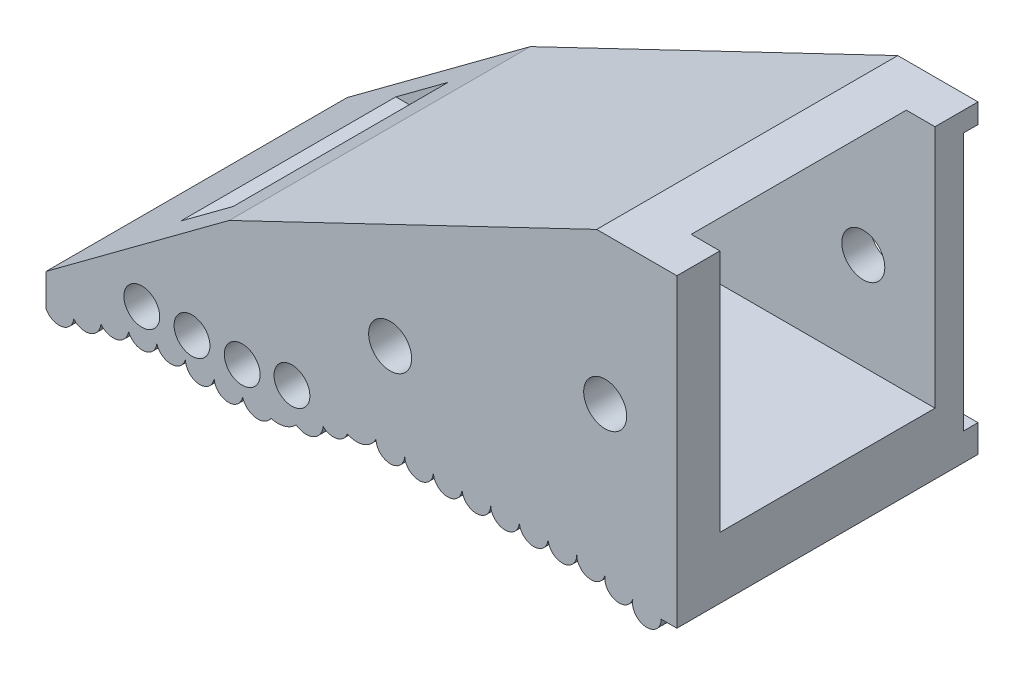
from build123d import *

# Parameters (mm, degrees)
SKETCH_1_W          = 44
SKETCH_1_H          = 25
EXTRUDE_1_DEPTH     = 3
EXTRUDE_2_DEPTH     = 15
SKETCH_3_W          = 44
SKETCH_3_H          = 25
EXTRUDE_3_DEPTH     = 3
SKETCH_4_OUTSIDE_W  = 56.958
SKETCH_4_OUTSIDE_H  = 37.958
CUT_EXTRUDE_1_DEPTH = 30
SKETCH_5_R          = 1.5
CUT_EXTRUDE_2_DEPTH = 30
SKETCH_6_R          = 1.5
CUT_EXTRUDE_3_DEPTH = 30
SKETCH_8_R          = 1.25
CUT_EXTRUDE_7_DEPTH = 30
SKETCH_9_W          = 8
SKETCH_9_H          = 18
CUT_EXTRUDE_8_DEPTH = 1


with BuildPart() as part:
    # Sketch 1 → Extrude 1 (new body)
    with BuildSketch(Plane.XY):
        with Locations((9.221698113, -4.932075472)):
            Rectangle(SKETCH_1_W, SKETCH_1_H)
    extrude(amount=EXTRUDE_1_DEPTH)

    # Sketch 2 → Extrude 2 (add)
    with BuildSketch(Plane.XY.offset(3)):
        Polygon((-8.778301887, -9.432075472), (31.221698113, -9.432075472), (31.221698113, -17.432075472), (-12.778301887, -17.432075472), (-12.778301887, 7.567924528), (29.221698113, 7.567924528), align=None)
    extrude(amount=EXTRUDE_2_DEPTH)

    # Sketch 3 → Extrude 3 (add)
    with BuildSketch(Plane.XY.offset(18)):
        with Locations((9.221698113, -4.932075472)):
            Rectangle(SKETCH_3_W, SKETCH_3_H)
    extrude(amount=EXTRUDE_3_DEPTH)

    # Sketch 4 outside → Cut-Extrude 1 (cut)
    with BuildSketch(Plane.XY.offset(21)):
        with Locations((9.222, -4.932)):
            Rectangle(SKETCH_4_OUTSIDE_W, SKETCH_4_OUTSIDE_H)
        with BuildLine():
            Line((0, -4.704131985), (-12.778301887, -14.170796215))
            Line((-12.778301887, -14.170796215), (-12.778301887, -16.432075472))
            ThreePointArc((-12.778301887, -16.432075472), (-11.683885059, -16.955812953), (-10.841254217, -16.082874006))
            ThreePointArc((-10.841254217, -16.082874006), (-9.682626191, -16.374535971), (-8.951584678, -15.429515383))
            ThreePointArc((-8.951584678, -15.429515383), (-7.815500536, -15.812514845), (-7.017721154, -14.917571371))
            ThreePointArc((-7.017721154, -14.917571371), (-5.934732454, -15.566074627), (-5.049134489, -14.666554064))
            ThreePointArc((-5.049134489, -14.666554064), (-4.028561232, -15.410161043), (-3.048843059, -14.613497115))
            ThreePointArc((-3.048843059, -14.613497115), (-2.084202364, -15.645515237), (-1.050130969, -14.683075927))
            ThreePointArc((-1.050130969, -14.683075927), (-0.154753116, -15.714579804), (0.934546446, -14.890487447))
            ThreePointArc((0.934546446, -14.890487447), (1.820834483, -15.692601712), (2.910143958, -15.200363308))
            ThreePointArc((2.910143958, -15.200363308), (3.858435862, -15.202893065), (4.674247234, -14.719451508))
            ThreePointArc((4.674247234, -14.719451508), (5.859175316, -14.838887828), (6.55334804, -13.871187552))
            ThreePointArc((6.55334804, -13.871187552), (7.501593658, -14.125868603), (8.238004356, -13.476460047))
            ThreePointArc((8.238004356, -13.476460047), (9.380760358, -13.545294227), (10.237483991, -12.785916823))
            ThreePointArc((10.237483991, -12.785916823), (11.237483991, -13.785916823), (12.237483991, -12.785916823))
            ThreePointArc((12.237483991, -12.785916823), (13.237483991, -13.785916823), (14.237483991, -12.785916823))
            ThreePointArc((14.237483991, -12.785916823), (15.237483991, -13.785916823), (16.237483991, -12.785916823))
            ThreePointArc((16.237483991, -12.785916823), (17.237483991, -13.785916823), (18.237483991, -12.785916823))
            ThreePointArc((18.237483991, -12.785916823), (19.237483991, -13.785916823), (20.237483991, -12.785916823))
            ThreePointArc((20.237483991, -12.785916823), (21.237483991, -13.785916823), (22.237483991, -12.785916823))
            ThreePointArc((22.237483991, -12.785916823), (23.237483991, -13.785916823), (24.237483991, -12.785916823))
            ThreePointArc((24.237483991, -12.785916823), (25.129833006, -13.780105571), (26.214306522, -12.99996762))
            ThreePointArc((26.214306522, -12.99996762), (26.956417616, -14.186083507), (28.157999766, -13.46928499))
            ThreePointArc((28.157999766, -13.46928499), (28.996166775, -14.716234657), (30.124870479, -13.724551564))
            Line((30.124870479, -13.724551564), (31.221698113, -13.724551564))
            Line((31.221698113, -13.724551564), (31.221698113, 7.567924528))
            Line((31.221698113, 7.567924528), (25.626938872, 7.567924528))
            Line((25.626938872, 7.567924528), (0, -4.704131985))
        make_face(mode=Mode.SUBTRACT)
    extrude(amount=-CUT_EXTRUDE_1_DEPTH, mode=Mode.SUBTRACT)

    # Sketch 5 → Cut-Extrude 2 (cut)
    with BuildSketch(Plane.XY.offset(21)):
        with Locations((26.221698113, -2.682075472)):
            Circle(SKETCH_5_R)
    extrude(amount=-CUT_EXTRUDE_2_DEPTH, mode=Mode.SUBTRACT)

    # Sketch 6 → Cut-Extrude 3 (cut)
    with BuildSketch(Plane.XY.offset(21)):
        with Locations((11.221698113, -6.682075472)):
            Circle(SKETCH_6_R)
    extrude(amount=-CUT_EXTRUDE_3_DEPTH, mode=Mode.SUBTRACT)

    # Sketch 8 → Cut-Extrude 7 (cut)
    with BuildSketch(Plane.XY.offset(21)):
        with Locations((-6.095292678, -12.953337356)):
            Circle(SKETCH_8_R)
        with Locations((-2.595292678, -12.953337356)):
            Circle(SKETCH_8_R)
        with Locations((0.904707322, -12.953337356)):
            Circle(SKETCH_8_R)
        with Locations((4.373632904, -12.487982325)):
            Circle(SKETCH_8_R)
    extrude(amount=-CUT_EXTRUDE_7_DEPTH, mode=Mode.SUBTRACT)

    # Sketch 9 → Cut-Extrude 8 (cut)
    with BuildSketch(Plane(origin=(0, 0, 0), x_dir=(-1, 0, 0), z_dir=(0, 0, -1))):
        with Locations((-27.221698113, -2.8056304)):
            Rectangle(SKETCH_9_W, SKETCH_9_H)
    extrude(amount=-CUT_EXTRUDE_8_DEPTH, mode=Mode.SUBTRACT)


solid = part.part
